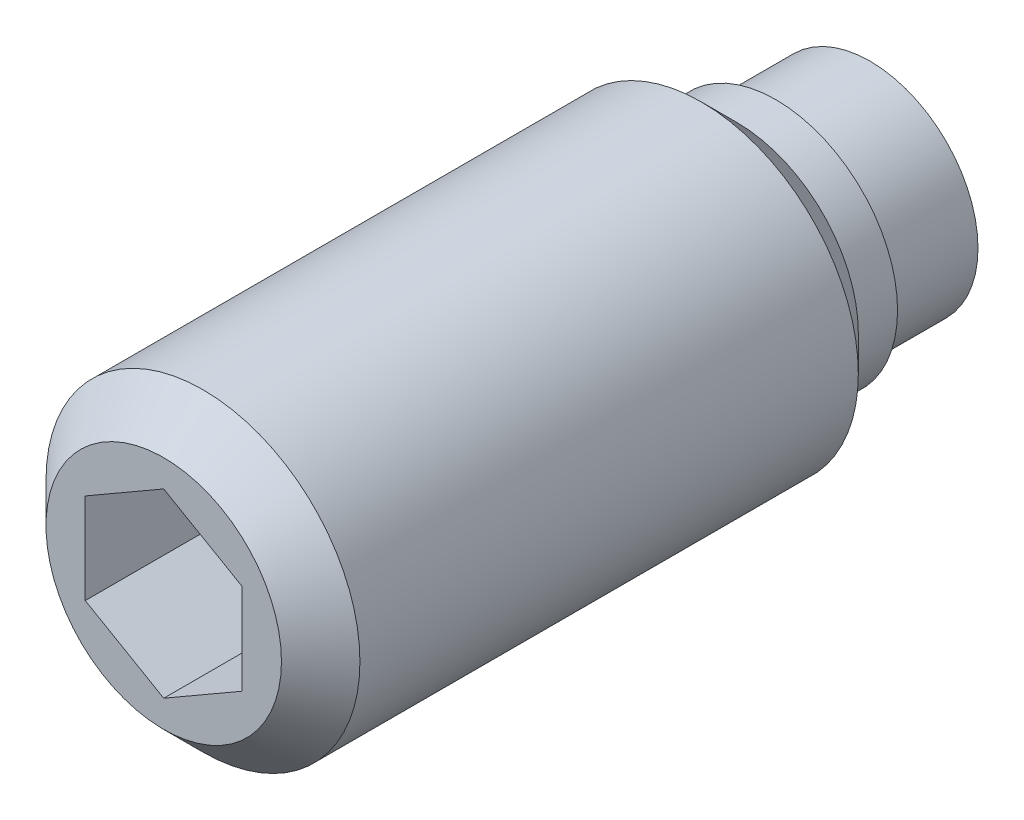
ISO-10303-21;
HEADER;
FILE_DESCRIPTION(('STEP AP214'),'2;1');
FILE_NAME('part.step','',(''),(''),'','','');
FILE_SCHEMA(('AUTOMOTIVE_DESIGN { 1 0 10303 214 1 1 1 1 }'));
ENDSEC;
DATA;
#1=APPLICATION_CONTEXT('core data for automotive mechanical design processes');
#2=APPLICATION_PROTOCOL_DEFINITION('international standard','automotive_design',2000,#1);
#3=PRODUCT_CONTEXT('',#1,'mechanical');
#4=PRODUCT('Part','Part','',(#3));
#5=PRODUCT_RELATED_PRODUCT_CATEGORY('part','',(#4));
#6=PRODUCT_DEFINITION_FORMATION('','',#4);
#7=PRODUCT_DEFINITION_CONTEXT('part definition',#1,'design');
#8=PRODUCT_DEFINITION('design','',#6,#7);
#9=PRODUCT_DEFINITION_SHAPE('','',#8);
#10=(LENGTH_UNIT() NAMED_UNIT(*) SI_UNIT(.MILLI.,.METRE.));
#11=(NAMED_UNIT(*) PLANE_ANGLE_UNIT() SI_UNIT($,.RADIAN.));
#12=(NAMED_UNIT(*) SI_UNIT($,.STERADIAN.) SOLID_ANGLE_UNIT());
#13=UNCERTAINTY_MEASURE_WITH_UNIT(LENGTH_MEASURE(1.E-05),#10,'distance_accuracy_value','');
#14=(GEOMETRIC_REPRESENTATION_CONTEXT(3) GLOBAL_UNCERTAINTY_ASSIGNED_CONTEXT((#13)) GLOBAL_UNIT_ASSIGNED_CONTEXT((#10,
#11,#12)) REPRESENTATION_CONTEXT('',''));
#15=CARTESIAN_POINT('',(0.,0.,0.));
#16=DIRECTION('',(0.,0.,1.));
#17=DIRECTION('',(1.,0.,0.));
#18=AXIS2_PLACEMENT_3D('',#15,#16,#17);
#19=CARTESIAN_POINT('',(0.,3.1,3.2));
#20=DIRECTION('',(0.,0.,1.));
#21=DIRECTION('',(1.,0.,0.));
#22=AXIS2_PLACEMENT_3D('',#19,#20,#21);
#23=PLANE('',#22);
#24=CARTESIAN_POINT('',(0.,0.,3.2));
#25=DIRECTION('',(0.,0.,-1.));
#26=DIRECTION('',(-1.,0.,0.));
#27=AXIS2_PLACEMENT_3D('',#24,#25,#26);
#28=CIRCLE('',#27,2.75);
#29=CARTESIAN_POINT('',(-2.75000000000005,0.,3.2));
#30=VERTEX_POINT('',#29);
#31=EDGE_CURVE('E124',#30,#30,#28,.T.);
#32=ORIENTED_EDGE('',*,*,#31,.F.);
#33=EDGE_LOOP('',(#32));
#34=FACE_BOUND('',#33,.T.);
#35=CARTESIAN_POINT('',(0.,0.,3.2));
#36=DIRECTION('',(0.,0.,-1.));
#37=DIRECTION('',(-1.,0.,0.));
#38=AXIS2_PLACEMENT_3D('',#35,#36,#37);
#39=CIRCLE('',#38,3.1);
#40=CARTESIAN_POINT('',(-3.10000000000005,0.,3.2));
#41=VERTEX_POINT('',#40);
#42=EDGE_CURVE('E127',#41,#41,#39,.T.);
#43=ORIENTED_EDGE('',*,*,#42,.T.);
#44=EDGE_LOOP('',(#43));
#45=FACE_BOUND('',#44,.T.);
#46=ADVANCED_FACE('F14',(#34,#45),#23,.F.);
#47=CARTESIAN_POINT('',(0.,0.,3.2));
#48=DIRECTION('',(0.,0.,-1.));
#49=DIRECTION('',(-1.,0.,0.));
#50=AXIS2_PLACEMENT_3D('',#47,#48,#49);
#51=CYLINDRICAL_SURFACE('',#50,4.);
#52=CARTESIAN_POINT('',(0.,0.,17.8));
#53=DIRECTION('',(0.,0.,1.));
#54=DIRECTION('',(1.,0.,0.));
#55=AXIS2_PLACEMENT_3D('',#52,#53,#54);
#56=CIRCLE('',#55,4.);
#57=CARTESIAN_POINT('',(3.99999999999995,0.,17.8));
#58=VERTEX_POINT('',#57);
#59=EDGE_CURVE('E9',#58,#58,#56,.F.);
#60=ORIENTED_EDGE('',*,*,#59,.T.);
#61=EDGE_LOOP('',(#60));
#62=FACE_BOUND('',#61,.T.);
#63=CARTESIAN_POINT('',(0.,0.,5.1));
#64=DIRECTION('',(0.,0.,-1.));
#65=DIRECTION('',(-1.,0.,0.));
#66=AXIS2_PLACEMENT_3D('',#63,#64,#65);
#67=CIRCLE('',#66,4.);
#68=CARTESIAN_POINT('',(-4.00000000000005,0.,5.1));
#69=VERTEX_POINT('',#68);
#70=EDGE_CURVE('E133',#69,#69,#67,.T.);
#71=ORIENTED_EDGE('',*,*,#70,.F.);
#72=EDGE_LOOP('',(#71));
#73=FACE_BOUND('',#72,.T.);
#74=ADVANCED_FACE('F151',(#62,#73),#51,.T.);
#75=CARTESIAN_POINT('',(0.,0.,5.1));
#76=DIRECTION('',(0.,0.,1.));
#77=DIRECTION('',(1.,0.,0.));
#78=AXIS2_PLACEMENT_3D('',#75,#76,#77);
#79=CONICAL_SURFACE('',#78,4.,0.785398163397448);
#80=CARTESIAN_POINT('',(0.,0.,4.2));
#81=DIRECTION('',(0.,0.,-1.));
#82=DIRECTION('',(-1.,0.,0.));
#83=AXIS2_PLACEMENT_3D('',#80,#81,#82);
#84=CIRCLE('',#83,3.1);
#85=CARTESIAN_POINT('',(-3.10000000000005,0.,4.2));
#86=VERTEX_POINT('',#85);
#87=EDGE_CURVE('E130',#86,#86,#84,.T.);
#88=ORIENTED_EDGE('',*,*,#87,.F.);
#89=EDGE_LOOP('',(#88));
#90=FACE_BOUND('',#89,.T.);
#91=ORIENTED_EDGE('',*,*,#70,.T.);
#92=EDGE_LOOP('',(#91));
#93=FACE_BOUND('',#92,.T.);
#94=ADVANCED_FACE('F158',(#90,#93),#79,.T.);
#95=CARTESIAN_POINT('',(0.,0.,3.2));
#96=DIRECTION('',(0.,0.,-1.));
#97=DIRECTION('',(-1.,0.,0.));
#98=AXIS2_PLACEMENT_3D('',#95,#96,#97);
#99=CYLINDRICAL_SURFACE('',#98,3.1);
#100=ORIENTED_EDGE('',*,*,#42,.F.);
#101=EDGE_LOOP('',(#100));
#102=FACE_BOUND('',#101,.T.);
#103=ORIENTED_EDGE('',*,*,#87,.T.);
#104=EDGE_LOOP('',(#103));
#105=FACE_BOUND('',#104,.T.);
#106=ADVANCED_FACE('F166',(#102,#105),#99,.T.);
#107=CARTESIAN_POINT('',(0.,0.,0.));
#108=DIRECTION('',(0.,0.,-1.));
#109=DIRECTION('',(-1.,0.,0.));
#110=AXIS2_PLACEMENT_3D('',#107,#108,#109);
#111=CYLINDRICAL_SURFACE('',#110,2.75);
#112=CARTESIAN_POINT('',(0.,0.,0.8));
#113=DIRECTION('',(0.,0.,-1.));
#114=DIRECTION('',(-1.,0.,0.));
#115=AXIS2_PLACEMENT_3D('',#112,#113,#114);
#116=CIRCLE('',#115,2.75);
#117=CARTESIAN_POINT('',(-2.75000000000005,0.,0.8));
#118=VERTEX_POINT('',#117);
#119=EDGE_CURVE('E114',#118,#118,#116,.T.);
#120=ORIENTED_EDGE('',*,*,#119,.F.);
#121=EDGE_LOOP('',(#120));
#122=FACE_BOUND('',#121,.T.);
#123=ORIENTED_EDGE('',*,*,#31,.T.);
#124=EDGE_LOOP('',(#123));
#125=FACE_BOUND('',#124,.T.);
#126=ADVANCED_FACE('F164',(#122,#125),#111,.T.);
#127=CARTESIAN_POINT('',(-0.0368577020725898,0.,4.99986414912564));
#128=DIRECTION('',(0.,-1.,0.));
#129=DIRECTION('',(-1.,0.,0.));
#130=AXIS2_PLACEMENT_3D('',#127,#128,#129);
#131=CIRCLE('',#130,4.99999999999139);
#132=TRIMMED_CURVE('',#131,(PARAMETER_VALUE(-1.57816793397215)),
(PARAMETER_VALUE(1.57816793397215)),.T.,.PARAMETER.);
#133=CARTESIAN_POINT('',(0.,0.,4.99986414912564));
#134=DIRECTION('',(0.,0.,-1.));
#135=AXIS1_PLACEMENT('',#133,#134);
#136=SURFACE_OF_REVOLUTION('',#132,#135);
#137=ORIENTED_EDGE('',*,*,#119,.T.);
#138=EDGE_LOOP('',(#137));
#139=FACE_BOUND('',#138,.T.);
#140=CARTESIAN_POINT('',(0.,0.,0.));
#141=VERTEX_POINT('',#140);
#142=VERTEX_LOOP('',#141);
#143=FACE_BOUND('',#142,.T.);
#144=ADVANCED_FACE('F198',(#139,#143),#136,.T.);
#145=CARTESIAN_POINT('',(0.,0.,18.8));
#146=DIRECTION('',(0.,0.,1.));
#147=DIRECTION('',(1.,0.,0.));
#148=AXIS2_PLACEMENT_3D('',#145,#146,#147);
#149=PLANE('',#148);
#150=CARTESIAN_POINT('',(0.,0.,18.8));
#151=DIRECTION('',(0.,0.,1.));
#152=DIRECTION('',(1.,0.,0.));
#153=AXIS2_PLACEMENT_3D('',#150,#151,#152);
#154=CIRCLE('',#153,3.);
#155=CARTESIAN_POINT('',(2.99999999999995,0.,18.8));
#156=VERTEX_POINT('',#155);
#157=EDGE_CURVE('E22',#156,#156,#154,.T.);
#158=ORIENTED_EDGE('',*,*,#157,.T.);
#159=EDGE_LOOP('',(#158));
#160=FACE_BOUND('',#159,.T.);
#161=DIRECTION('',(-0.866025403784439,0.5,0.));
#162=VECTOR('',#161,1.);
#163=CARTESIAN_POINT('',(2.,1.15470053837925,18.8));
#164=LINE('',#163,#162);
#165=CARTESIAN_POINT('',(2.,1.15470053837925,18.8));
#166=VERTEX_POINT('',#165);
#167=CARTESIAN_POINT('',(0.,2.30940107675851,18.8));
#168=VERTEX_POINT('',#167);
#169=EDGE_CURVE('E29',#166,#168,#164,.T.);
#170=ORIENTED_EDGE('',*,*,#169,.F.);
#171=DIRECTION('',(0.,1.,0.));
#172=VECTOR('',#171,1.);
#173=CARTESIAN_POINT('',(2.,-1.15470053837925,18.8));
#174=LINE('',#173,#172);
#175=CARTESIAN_POINT('',(2.,-1.15470053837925,18.8));
#176=VERTEX_POINT('',#175);
#177=EDGE_CURVE('E88',#176,#166,#174,.T.);
#178=ORIENTED_EDGE('',*,*,#177,.F.);
#179=DIRECTION('',(0.866025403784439,0.5,0.));
#180=VECTOR('',#179,1.);
#181=CARTESIAN_POINT('',(0.,-2.30940107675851,18.8));
#182=LINE('',#181,#180);
#183=CARTESIAN_POINT('',(0.,-2.30940107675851,18.8));
#184=VERTEX_POINT('',#183);
#185=EDGE_CURVE('E91',#184,#176,#182,.T.);
#186=ORIENTED_EDGE('',*,*,#185,.F.);
#187=DIRECTION('',(0.866025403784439,-0.5,0.));
#188=VECTOR('',#187,1.);
#189=CARTESIAN_POINT('',(-2.,-1.15470053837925,18.8));
#190=LINE('',#189,#188);
#191=CARTESIAN_POINT('',(-2.,-1.15470053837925,18.8));
#192=VERTEX_POINT('',#191);
#193=EDGE_CURVE('E107',#192,#184,#190,.T.);
#194=ORIENTED_EDGE('',*,*,#193,.F.);
#195=DIRECTION('',(0.,-1.,0.));
#196=VECTOR('',#195,1.);
#197=CARTESIAN_POINT('',(-2.,1.15470053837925,18.8));
#198=LINE('',#197,#196);
#199=CARTESIAN_POINT('',(-2.,1.15470053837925,18.8));
#200=VERTEX_POINT('',#199);
#201=EDGE_CURVE('E104',#200,#192,#198,.T.);
#202=ORIENTED_EDGE('',*,*,#201,.F.);
#203=DIRECTION('',(-0.866025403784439,-0.5,0.));
#204=VECTOR('',#203,1.);
#205=CARTESIAN_POINT('',(0.,2.30940107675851,18.8));
#206=LINE('',#205,#204);
#207=EDGE_CURVE('E102',#168,#200,#206,.T.);
#208=ORIENTED_EDGE('',*,*,#207,.F.);
#209=EDGE_LOOP('',(#170,#178,#186,#194,#202,#208));
#210=FACE_BOUND('',#209,.T.);
#211=ADVANCED_FACE('F138',(#160,#210),#149,.T.);
#212=CARTESIAN_POINT('',(2.,1.15470053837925,14.8));
#213=DIRECTION('',(0.5,0.866025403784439,0.));
#214=DIRECTION('',(-0.866025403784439,0.5,0.));
#215=AXIS2_PLACEMENT_3D('',#212,#213,#214);
#216=PLANE('',#215);
#217=ORIENTED_EDGE('',*,*,#169,.T.);
#218=DIRECTION('',(0.,0.,1.));
#219=VECTOR('',#218,1.);
#220=CARTESIAN_POINT('',(0.,2.30940107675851,14.8));
#221=LINE('',#220,#219);
#222=CARTESIAN_POINT('',(0.,2.30940107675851,14.8));
#223=VERTEX_POINT('',#222);
#224=EDGE_CURVE('E65',#223,#168,#221,.T.);
#225=ORIENTED_EDGE('',*,*,#224,.F.);
#226=DIRECTION('',(-0.866025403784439,0.5,0.));
#227=VECTOR('',#226,1.);
#228=CARTESIAN_POINT('',(2.,1.15470053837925,14.8));
#229=LINE('',#228,#227);
#230=CARTESIAN_POINT('',(2.,1.15470053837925,14.8));
#231=VERTEX_POINT('',#230);
#232=EDGE_CURVE('E69',#231,#223,#229,.T.);
#233=ORIENTED_EDGE('',*,*,#232,.F.);
#234=DIRECTION('',(0.,0.,1.));
#235=VECTOR('',#234,1.);
#236=CARTESIAN_POINT('',(2.,1.15470053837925,14.8));
#237=LINE('',#236,#235);
#238=EDGE_CURVE('E112',#231,#166,#237,.T.);
#239=ORIENTED_EDGE('',*,*,#238,.T.);
#240=EDGE_LOOP('',(#217,#225,#233,#239));
#241=FACE_BOUND('',#240,.T.);
#242=ADVANCED_FACE('F67',(#241),#216,.F.);
#243=CARTESIAN_POINT('',(2.,-1.15470053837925,14.8));
#244=DIRECTION('',(1.,0.,0.));
#245=DIRECTION('',(0.,0.,-1.));
#246=AXIS2_PLACEMENT_3D('',#243,#244,#245);
#247=PLANE('',#246);
#248=ORIENTED_EDGE('',*,*,#177,.T.);
#249=ORIENTED_EDGE('',*,*,#238,.F.);
#250=DIRECTION('',(0.,1.,0.));
#251=VECTOR('',#250,1.);
#252=CARTESIAN_POINT('',(2.,-1.15470053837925,14.8));
#253=LINE('',#252,#251);
#254=CARTESIAN_POINT('',(2.,-1.15470053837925,14.8));
#255=VERTEX_POINT('',#254);
#256=EDGE_CURVE('E75',#255,#231,#253,.T.);
#257=ORIENTED_EDGE('',*,*,#256,.F.);
#258=DIRECTION('',(0.,0.,1.));
#259=VECTOR('',#258,1.);
#260=CARTESIAN_POINT('',(2.,-1.15470053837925,14.8));
#261=LINE('',#260,#259);
#262=EDGE_CURVE('E115',#255,#176,#261,.T.);
#263=ORIENTED_EDGE('',*,*,#262,.T.);
#264=EDGE_LOOP('',(#248,#249,#257,#263));
#265=FACE_BOUND('',#264,.T.);
#266=ADVANCED_FACE('F220',(#265),#247,.F.);
#267=CARTESIAN_POINT('',(0.,-2.30940107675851,14.8));
#268=DIRECTION('',(0.5,-0.866025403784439,0.));
#269=DIRECTION('',(0.866025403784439,0.5,0.));
#270=AXIS2_PLACEMENT_3D('',#267,#268,#269);
#271=PLANE('',#270);
#272=ORIENTED_EDGE('',*,*,#185,.T.);
#273=ORIENTED_EDGE('',*,*,#262,.F.);
#274=DIRECTION('',(0.866025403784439,0.5,0.));
#275=VECTOR('',#274,1.);
#276=CARTESIAN_POINT('',(0.,-2.30940107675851,14.8));
#277=LINE('',#276,#275);
#278=CARTESIAN_POINT('',(0.,-2.30940107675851,14.8));
#279=VERTEX_POINT('',#278);
#280=EDGE_CURVE('E98',#279,#255,#277,.T.);
#281=ORIENTED_EDGE('',*,*,#280,.F.);
#282=DIRECTION('',(0.,0.,1.));
#283=VECTOR('',#282,1.);
#284=CARTESIAN_POINT('',(0.,-2.30940107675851,14.8));
#285=LINE('',#284,#283);
#286=EDGE_CURVE('E117',#279,#184,#285,.T.);
#287=ORIENTED_EDGE('',*,*,#286,.T.);
#288=EDGE_LOOP('',(#272,#273,#281,#287));
#289=FACE_BOUND('',#288,.T.);
#290=ADVANCED_FACE('F228',(#289),#271,.F.);
#291=CARTESIAN_POINT('',(-2.,-1.15470053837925,14.8));
#292=DIRECTION('',(-0.5,-0.866025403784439,0.));
#293=DIRECTION('',(0.866025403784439,-0.5,0.));
#294=AXIS2_PLACEMENT_3D('',#291,#292,#293);
#295=PLANE('',#294);
#296=ORIENTED_EDGE('',*,*,#193,.T.);
#297=ORIENTED_EDGE('',*,*,#286,.F.);
#298=DIRECTION('',(0.866025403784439,-0.5,0.));
#299=VECTOR('',#298,1.);
#300=CARTESIAN_POINT('',(-2.,-1.15470053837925,14.8));
#301=LINE('',#300,#299);
#302=CARTESIAN_POINT('',(-2.,-1.15470053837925,14.8));
#303=VERTEX_POINT('',#302);
#304=EDGE_CURVE('E95',#303,#279,#301,.T.);
#305=ORIENTED_EDGE('',*,*,#304,.F.);
#306=DIRECTION('',(0.,0.,1.));
#307=VECTOR('',#306,1.);
#308=CARTESIAN_POINT('',(-2.,-1.15470053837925,14.8));
#309=LINE('',#308,#307);
#310=EDGE_CURVE('E119',#303,#192,#309,.T.);
#311=ORIENTED_EDGE('',*,*,#310,.T.);
#312=EDGE_LOOP('',(#296,#297,#305,#311));
#313=FACE_BOUND('',#312,.T.);
#314=ADVANCED_FACE('F237',(#313),#295,.F.);
#315=CARTESIAN_POINT('',(-2.,1.15470053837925,14.8));
#316=DIRECTION('',(-1.,0.,0.));
#317=DIRECTION('',(0.,0.,1.));
#318=AXIS2_PLACEMENT_3D('',#315,#316,#317);
#319=PLANE('',#318);
#320=ORIENTED_EDGE('',*,*,#201,.T.);
#321=ORIENTED_EDGE('',*,*,#310,.F.);
#322=DIRECTION('',(0.,-1.,0.));
#323=VECTOR('',#322,1.);
#324=CARTESIAN_POINT('',(-2.,1.15470053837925,14.8));
#325=LINE('',#324,#323);
#326=CARTESIAN_POINT('',(-2.,1.15470053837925,14.8));
#327=VERTEX_POINT('',#326);
#328=EDGE_CURVE('E83',#327,#303,#325,.T.);
#329=ORIENTED_EDGE('',*,*,#328,.F.);
#330=DIRECTION('',(0.,0.,1.));
#331=VECTOR('',#330,1.);
#332=CARTESIAN_POINT('',(-2.,1.15470053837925,14.8));
#333=LINE('',#332,#331);
#334=EDGE_CURVE('E74',#327,#200,#333,.T.);
#335=ORIENTED_EDGE('',*,*,#334,.T.);
#336=EDGE_LOOP('',(#320,#321,#329,#335));
#337=FACE_BOUND('',#336,.T.);
#338=ADVANCED_FACE('F246',(#337),#319,.F.);
#339=CARTESIAN_POINT('',(0.,2.30940107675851,14.8));
#340=DIRECTION('',(-0.5,0.866025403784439,0.));
#341=DIRECTION('',(-0.866025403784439,-0.5,0.));
#342=AXIS2_PLACEMENT_3D('',#339,#340,#341);
#343=PLANE('',#342);
#344=ORIENTED_EDGE('',*,*,#207,.T.);
#345=ORIENTED_EDGE('',*,*,#334,.F.);
#346=DIRECTION('',(-0.866025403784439,-0.5,0.));
#347=VECTOR('',#346,1.);
#348=CARTESIAN_POINT('',(0.,2.30940107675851,14.8));
#349=LINE('',#348,#347);
#350=EDGE_CURVE('E78',#223,#327,#349,.T.);
#351=ORIENTED_EDGE('',*,*,#350,.F.);
#352=ORIENTED_EDGE('',*,*,#224,.T.);
#353=EDGE_LOOP('',(#344,#345,#351,#352));
#354=FACE_BOUND('',#353,.T.);
#355=ADVANCED_FACE('F79',(#354),#343,.F.);
#356=CARTESIAN_POINT('',(0.,0.,14.8));
#357=DIRECTION('',(0.,0.,1.));
#358=DIRECTION('',(1.,0.,0.));
#359=AXIS2_PLACEMENT_3D('',#356,#357,#358);
#360=PLANE('',#359);
#361=ORIENTED_EDGE('',*,*,#232,.T.);
#362=ORIENTED_EDGE('',*,*,#350,.T.);
#363=ORIENTED_EDGE('',*,*,#328,.T.);
#364=ORIENTED_EDGE('',*,*,#304,.T.);
#365=ORIENTED_EDGE('',*,*,#280,.T.);
#366=ORIENTED_EDGE('',*,*,#256,.T.);
#367=EDGE_LOOP('',(#361,#362,#363,#364,#365,#366));
#368=FACE_BOUND('',#367,.T.);
#369=ADVANCED_FACE('F85',(#368),#360,.T.);
#370=CARTESIAN_POINT('',(0.,0.,18.8));
#371=DIRECTION('',(0.,0.,-1.));
#372=DIRECTION('',(-1.,0.,0.));
#373=AXIS2_PLACEMENT_3D('',#370,#371,#372);
#374=CONICAL_SURFACE('',#373,3.,0.785398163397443);
#375=ORIENTED_EDGE('',*,*,#59,.F.);
#376=EDGE_LOOP('',(#375));
#377=FACE_BOUND('',#376,.T.);
#378=ORIENTED_EDGE('',*,*,#157,.F.);
#379=EDGE_LOOP('',(#378));
#380=FACE_BOUND('',#379,.T.);
#381=ADVANCED_FACE('F16',(#377,#380),#374,.T.);
#382=CLOSED_SHELL('',(#46,#74,#94,#106,#126,#144,#211,#242,#266,#290,#314,#338,#355,#369,#381));
#383=MANIFOLD_SOLID_BREP('B1',#382);
#384=ADVANCED_BREP_SHAPE_REPRESENTATION('',(#18,#383),#14);
#385=SHAPE_DEFINITION_REPRESENTATION(#9,#384);
ENDSEC;
END-ISO-10303-21;
